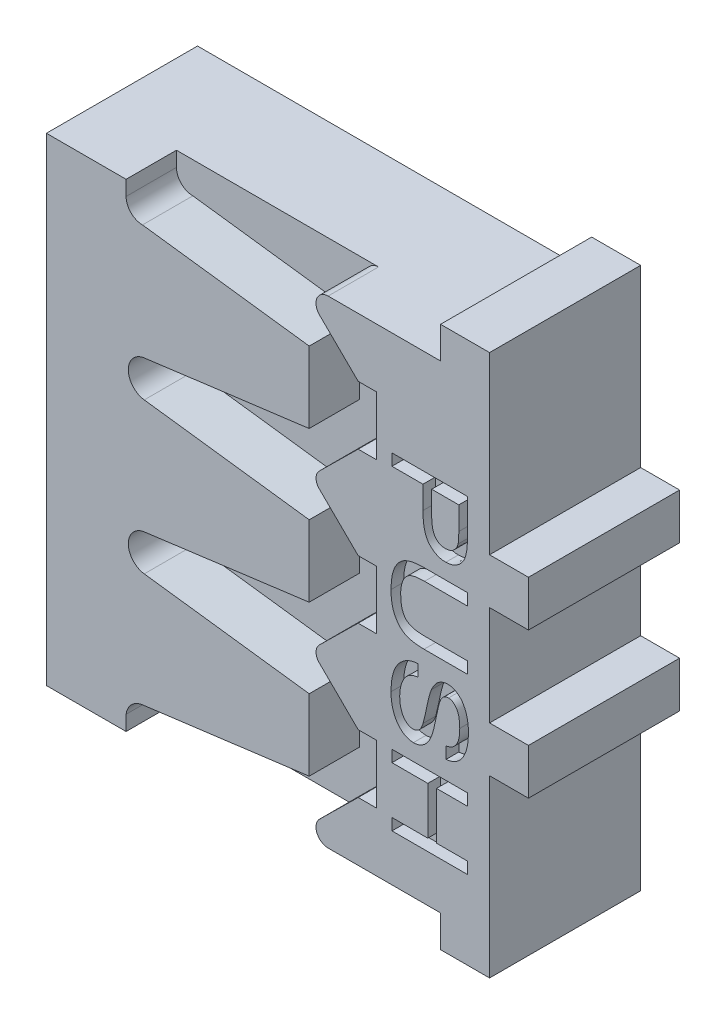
from build123d import *

# Parameters (mm, degrees)
EXTRUSION1_DEPTH                  = 1.2
ENL_V_START                       = -1.2
ENL_V_MAT_EXTRU_1_DEPTH           = 0.4
ESQUISSE4_W                       = 0.8
ESQUISSE4_H                       = 1
ENL_V_MAT_EXTRU_2_DEPTH           = 2
ENL_V_MAT_EXTRU_2_DRAFT           = -10
ENL_V_MAT_EXTRU_2_PROFILE_2_DEPTH = 2
ENL_V_MAT_EXTRU_2_PROFILE_2_DRAFT = -10
ENL_V_MAT_EXTRU_2_PROFILE_3_DEPTH = 2
ENL_V_MAT_EXTRU_2_PROFILE_3_DRAFT = -10
ENL_V_MAT_EXTRU_3_DEPTH           = 0.1


with BuildPart() as part:
    # Esquisse2 → Extrusion1 (new body)
    with BuildSketch(Plane.XY):
        Polygon((-3.519339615, -1.899454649), (-0.389123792, -1.89807661), (-0.389123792, -2.150946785), (0, -2.150946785), (0, -0.759816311), (0.309025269, -0.759816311), (0.309025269, -0.396703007), (0, -0.396703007), (0, 0.396703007), (0.309025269, 0.396703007), (0.309025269, 0.759816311), (0, 0.759816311), (0, 2.150602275), (-0.389123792, 2.150602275), (-0.389123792, 1.89807661), (-3.519339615, 1.899454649), align=None)
    extrude(amount=-EXTRUSION1_DEPTH)

    # Esquisse3 → Enl_v. mat.-Extru.1 (cut)
    with BuildSketch(Plane(origin=(0, 0, -1.2), x_dir=(-1, 0, 0), z_dir=(0, 0, -1)).offset(ENL_V_START)):
        with BuildLine():
            Line((2.886647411, 1.899454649), (2.886647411, 1.780943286))
            ThreePointArc((2.886647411, 1.780943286), (2.848526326, 1.688738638), (2.756422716, 1.650374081))
            Line((2.756422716, 1.650374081), (1.432471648, 1.479152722))
            Line((1.432471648, 1.479152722), (1.432471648, 0.912089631))
            Line((1.432471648, 0.912089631), (2.742297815, 0.742590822))
            ThreePointArc((2.742297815, 0.742590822), (2.869171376, 0.598241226), (2.742297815, 0.45389163))
            Line((2.742297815, 0.45389163), (1.432471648, 0.28439282))
            Line((1.432471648, 0.28439282), (1.432471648, -0.282670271))
            Line((1.432471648, -0.282670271), (2.742297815, -0.45389163))
            ThreePointArc((2.742297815, -0.45389163), (2.869006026, -0.598241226), (2.742297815, -0.742590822))
            Line((2.742297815, -0.742590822), (1.432471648, -0.912089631))
            Line((1.432471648, -0.912089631), (1.432471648, -1.479152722))
            Line((1.432471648, -1.479152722), (2.756422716, -1.650374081))
            ThreePointArc((2.756422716, -1.650374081), (2.843720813, -1.693300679), (2.886647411, -1.780598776))
            Line((2.886647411, -1.780598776), (2.886647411, -1.899454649))
            Line((2.886647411, -1.899454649), (2.886647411, -1.94882687))
            Line((2.886647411, -1.94882687), (1.281920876, -1.94882687))
            Line((1.281920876, -1.94882687), (1.281920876, -1.89807661))
            ThreePointArc((1.281920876, -1.89807661), (1.370634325, -1.839666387), (1.35185636, -1.735123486))
            Line((1.35185636, -1.735123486), (1.043520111, -1.431265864))
            Line((1.043520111, -1.431265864), (0.899859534, -1.431265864))
            Line((0.899859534, -1.431265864), (0.899859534, -0.964455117))
            Line((0.899859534, -0.964455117), (1.043520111, -0.964455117))
            Line((1.043520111, -0.964455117), (1.35185636, -0.660597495))
            ThreePointArc((1.35185636, -0.660597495), (1.377880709, -0.598413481), (1.35185636, -0.536229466))
            Line((1.35185636, -0.536229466), (1.043520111, -0.232371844))
            Line((1.043520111, -0.232371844), (0.899859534, -0.232371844))
            Line((0.899859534, -0.232371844), (0.899859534, 0.232371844))
            Line((0.899859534, 0.232371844), (1.043520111, 0.232371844))
            Line((1.043520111, 0.232371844), (1.35185636, 0.536229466))
            ThreePointArc((1.35185636, 0.536229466), (1.377808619, 0.598241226), (1.35185636, 0.660252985))
            Line((1.35185636, 0.660252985), (1.043520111, 0.964455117))
            Line((1.043520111, 0.964455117), (0.899859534, 0.964455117))
            Line((0.899859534, 0.964455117), (0.899859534, 1.431265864))
            Line((0.899859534, 1.431265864), (1.043520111, 1.431265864))
            Line((1.043520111, 1.431265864), (1.35185636, 1.735123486))
            ThreePointArc((1.35185636, 1.735123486), (1.370634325, 1.839666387), (1.281920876, 1.89807661))
            Line((1.281920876, 1.89807661), (1.281920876, 1.925522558))
            Line((1.281920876, 1.925522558), (2.886647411, 1.925522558))
            Line((2.886647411, 1.925522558), (2.886647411, 1.899454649))
        make_face()
    extrude(amount=ENL_V_MAT_EXTRU_1_DEPTH, mode=Mode.SUBTRACT)


with BuildPart() as enl_v_mat_extru_2_tool:
    # Esquisse4 → Enl_v. mat.-Extru.2 (with draft: the straight prism first)
    with BuildSketch(Plane.ZY.offset(3.519339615)):
        with Locations((-0.6, 1.2)):
            Rectangle(ESQUISSE4_W, ESQUISSE4_H)
    extrude(amount=-ENL_V_MAT_EXTRU_2_DEPTH)
    # Enl_v. mat.-Extru.2: the draft: its side faces are tilted about the plane it starts from
    enl_v_mat_extru_2_sides = [enl_v_mat_extru_2_tool.faces().sort_by_distance(p)[0] for p in [
        (-2.519339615, 1.7, -0.6),
        (-2.519339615, 1.2, -1),
        (-2.519339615, 0.7, -0.6),
        (-2.519339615, 1.2, -0.2),
    ]]
    draft(enl_v_mat_extru_2_sides, Plane.ZY.offset(3.519339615), ENL_V_MAT_EXTRU_2_DRAFT)


with BuildPart() as part_1:
    add(part.part)

    # Enl_v. mat.-Extru.2: cut by enl_v_mat_extru_2_tool
    add(enl_v_mat_extru_2_tool.part, mode=Mode.SUBTRACT)


with BuildPart() as enl_v_mat_extru_2_profile_2_tool:
    # Esquisse4 → Enl_v. mat.-Extru.2 profile 2 (with draft: the straight prism first)
    with BuildSketch(Plane.ZY.offset(3.519339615)):
        with Locations((-0.6, 0)):
            Rectangle(ESQUISSE4_W, ESQUISSE4_H)
    extrude(amount=-ENL_V_MAT_EXTRU_2_PROFILE_2_DEPTH)
    # Enl_v. mat.-Extru.2 profile 2: the draft: its side faces are tilted about the plane it starts from
    enl_v_mat_extru_2_profile_2_sides = [enl_v_mat_extru_2_profile_2_tool.faces().sort_by_distance(p)[0] for p in [
        (-2.519339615, 0.5, -0.6),
        (-2.519339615, 0, -1),
        (-2.519339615, -0.5, -0.6),
        (-2.519339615, 0, -0.2),
    ]]
    draft(enl_v_mat_extru_2_profile_2_sides, Plane.ZY.offset(3.519339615), ENL_V_MAT_EXTRU_2_PROFILE_2_DRAFT)


with BuildPart() as part_2:
    add(part_1.part)

    # Enl_v. mat.-Extru.2 profile 2: cut by enl_v_mat_extru_2_profile_2_tool
    add(enl_v_mat_extru_2_profile_2_tool.part, mode=Mode.SUBTRACT)


with BuildPart() as enl_v_mat_extru_2_profile_3_tool:
    # Esquisse4 → Enl_v. mat.-Extru.2 profile 3 (with draft: the straight prism first)
    with BuildSketch(Plane.ZY.offset(3.519339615)):
        with Locations((-0.6, -1.2)):
            Rectangle(ESQUISSE4_W, ESQUISSE4_H)
    extrude(amount=-ENL_V_MAT_EXTRU_2_PROFILE_3_DEPTH)
    # Enl_v. mat.-Extru.2 profile 3: the draft: its side faces are tilted about the plane it starts from
    enl_v_mat_extru_2_profile_3_sides = [enl_v_mat_extru_2_profile_3_tool.faces().sort_by_distance(p)[0] for p in [
        (-2.519339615, -0.7, -0.6),
        (-2.519339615, -1.2, -1),
        (-2.519339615, -1.7, -0.6),
        (-2.519339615, -1.2, -0.2),
    ]]
    draft(enl_v_mat_extru_2_profile_3_sides, Plane.ZY.offset(3.519339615), ENL_V_MAT_EXTRU_2_PROFILE_3_DRAFT)


with BuildPart() as part_3:
    add(part_2.part)

    # Enl_v. mat.-Extru.2 profile 3: cut by enl_v_mat_extru_2_profile_3_tool
    add(enl_v_mat_extru_2_profile_3_tool.part, mode=Mode.SUBTRACT)

    # Esquisse6 → Enl_v. mat.-Extru.3 (cut)
    # profile 1 of 4: a face of its own
    with BuildSketch(Plane.XY):
        with BuildLine():
            Line((-0.775194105, 1.07322281), (-0.175194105, 1.07322281))
            Line((-0.175194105, 1.07322281), (-0.175194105, 0.80711704))
            add(Edge.make_bspline(
                [(-0.175194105, 0.80711704), (-0.175228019, 0.801427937), (-0.1752937, 0.790409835), (-0.175489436, 0.774421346), (-0.176002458, 0.759477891), (-0.176601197, 0.745535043), (-0.177271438, 0.732626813), (-0.178232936, 0.720762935), (-0.179435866, 0.709945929), (-0.180388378, 0.703068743), (-0.180843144, 0.69978531)],
                knots=[0, 0, 0, 0, 1.269345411, 2.458344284, 3.56733582, 4.605202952, 5.572085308, 6.451004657, 7.260450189, 8, 8, 8, 8], degree=3))
            add(Edge.make_bspline(
                [(-0.180843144, 0.69978531), (-0.182176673, 0.691462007), (-0.184757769, 0.675351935), (-0.190943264, 0.652417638), (-0.198678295, 0.631510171), (-0.20824188, 0.61265045), (-0.219616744, 0.595691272), (-0.233171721, 0.580617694), (-0.248729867, 0.567256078), (-0.266164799, 0.555743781), (-0.285013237, 0.546337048), (-0.305106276, 0.53976258), (-0.326051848, 0.535447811), (-0.340396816, 0.534992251), (-0.347670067, 0.534761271)],
                knots=[0, 0, 0, 0, 1.172642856, 2.269695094, 3.30028765, 4.270448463, 5.206197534, 6.134271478, 7.083302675, 8.053062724, 9.035676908, 10.005581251, 10.988780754, 12, 12, 12, 12], degree=3))
            add(Edge.make_bspline(
                [(-0.347670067, 0.534761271), (-0.353891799, 0.534894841), (-0.366159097, 0.535158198), (-0.384145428, 0.538088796), (-0.401450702, 0.542474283), (-0.418018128, 0.548778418), (-0.433845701, 0.556892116), (-0.448947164, 0.56677014), (-0.463164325, 0.578622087), (-0.476945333, 0.592039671), (-0.489454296, 0.608052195), (-0.500188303, 0.626969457), (-0.509129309, 0.64876271), (-0.516350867, 0.673400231), (-0.522072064, 0.700853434), (-0.526243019, 0.731166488), (-0.52856207, 0.76441231), (-0.528876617, 0.787522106), (-0.529040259, 0.799544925)],
                knots=[0, 0, 0, 0, 0.820402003, 1.61757449, 2.398590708, 3.17340736, 3.951410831, 4.741873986, 5.54955128, 6.390799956, 7.276093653, 8.221156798, 9.252224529, 10.378070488, 11.604879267, 12.950126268, 14.413310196, 16, 16, 16, 16], degree=3))
            Line((-0.529040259, 0.799544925), (-0.529040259, 0.980915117))
            Line((-0.529040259, 0.980915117), (-0.775194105, 0.980915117))
            Line((-0.775194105, 0.980915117), (-0.775194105, 1.07322281))
        make_face()
        with BuildLine():
            Line((-0.45980949, 0.980915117), (-0.45980949, 0.795939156))
            add(Edge.make_bspline(
                [(-0.45980949, 0.795939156), (-0.45971218, 0.788565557), (-0.459524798, 0.77436676), (-0.458243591, 0.75390069), (-0.455975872, 0.735121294), (-0.452871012, 0.71797572), (-0.448989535, 0.70242658), (-0.444094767, 0.688512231), (-0.438214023, 0.676289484), (-0.431429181, 0.665671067), (-0.423760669, 0.656570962), (-0.415383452, 0.648707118), (-0.406364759, 0.641847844), (-0.396424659, 0.636493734), (-0.385871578, 0.632217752), (-0.374568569, 0.629223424), (-0.36255342, 0.627399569), (-0.354287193, 0.627180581), (-0.350073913, 0.627068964)],
                knots=[0, 0, 0, 0, 1.547334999, 2.979589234, 4.300842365, 5.514546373, 6.634031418, 7.660497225, 8.604305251, 9.474181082, 10.297681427, 11.0946609, 11.881599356, 12.667998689, 13.45641783, 14.266068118, 15.116218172, 16, 16, 16, 16], degree=3))
            add(Edge.make_bspline(
                [(-0.350073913, 0.627068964), (-0.343958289, 0.627337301), (-0.332054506, 0.627859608), (-0.314895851, 0.632200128), (-0.299111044, 0.639378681), (-0.28497787, 0.649454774), (-0.272534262, 0.661652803), (-0.262536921, 0.675992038), (-0.254419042, 0.691915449), (-0.251307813, 0.703555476), (-0.249713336, 0.709520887)],
                knots=[0, 0, 0, 0, 1.041408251, 2.0270537, 2.995919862, 3.981281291, 4.971365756, 5.951148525, 6.949981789, 8, 8, 8, 8], degree=3))
            add(Edge.make_bspline(
                [(-0.249713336, 0.709520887), (-0.249291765, 0.711721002), (-0.248367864, 0.716542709), (-0.247357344, 0.72445186), (-0.246359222, 0.733582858), (-0.245707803, 0.743971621), (-0.245061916, 0.755628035), (-0.244766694, 0.768574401), (-0.244508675, 0.782797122), (-0.244453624, 0.792693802), (-0.244424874, 0.797862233)],
                knots=[0, 0, 0, 0, 0.606528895, 1.329250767, 2.158400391, 3.093761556, 4.147600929, 5.319844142, 6.600318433, 8, 8, 8, 8], degree=3))
            Line((-0.244424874, 0.797862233), (-0.244424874, 0.980915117))
            Line((-0.244424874, 0.980915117), (-0.45980949, 0.980915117))
        make_face(mode=Mode.SUBTRACT)
    # profile 2 of 4: a face of its own
    with BuildSketch(Plane.XY):
        with BuildLine():
            Line((-0.175194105, -0.057546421), (-0.175194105, -0.149854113))
            Line((-0.175194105, -0.149854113), (-0.520386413, -0.149854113))
            add(Edge.make_bspline(
                [(-0.520386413, -0.149854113), (-0.527720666, -0.149805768), (-0.541999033, -0.14971165), (-0.562794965, -0.148382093), (-0.58247625, -0.146757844), (-0.600935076, -0.143872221), (-0.618307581, -0.140635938), (-0.634467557, -0.13637951), (-0.649492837, -0.1314843), (-0.663517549, -0.125867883), (-0.67655064, -0.118984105), (-0.688942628, -0.111087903), (-0.700699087, -0.101872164), (-0.711701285, -0.09135999), (-0.722264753, -0.079771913), (-0.732083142, -0.066858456), (-0.741340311, -0.052752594), (-0.750007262, -0.037493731), (-0.757874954, -0.020989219), (-0.764563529, -0.003161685), (-0.770188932, 0.015932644), (-0.774866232, 0.036198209), (-0.778432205, 0.057720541), (-0.78106987, 0.080420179), (-0.782653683, 0.104409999), (-0.782807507, 0.120816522), (-0.782886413, 0.129232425)],
                knots=[0, 0, 0, 0, 1.190898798, 2.31844891, 3.383533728, 4.396690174, 5.351213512, 6.252371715, 7.10835201, 7.916711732, 8.702523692, 9.498506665, 10.300319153, 11.124215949, 11.967213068, 12.844372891, 13.755738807, 14.705660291, 15.692332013, 16.721965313, 17.79455647, 18.923101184, 20.097640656, 21.335723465, 22.633330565, 24, 24, 24, 24], degree=3))
            add(Edge.make_bspline(
                [(-0.782886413, 0.129232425), (-0.782786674, 0.137407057), (-0.782591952, 0.153366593), (-0.781291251, 0.176750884), (-0.778985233, 0.199001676), (-0.77592876, 0.220157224), (-0.7718652, 0.240151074), (-0.766786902, 0.258958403), (-0.760932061, 0.276633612), (-0.754219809, 0.293216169), (-0.746472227, 0.308582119), (-0.7381143, 0.322953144), (-0.728839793, 0.336118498), (-0.718678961, 0.348041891), (-0.707829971, 0.358944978), (-0.696150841, 0.368720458), (-0.683594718, 0.377302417), (-0.670106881, 0.384650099), (-0.6556401, 0.391088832), (-0.639989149, 0.396567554), (-0.623085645, 0.401261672), (-0.604971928, 0.40505012), (-0.585596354, 0.408061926), (-0.564979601, 0.410215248), (-0.543075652, 0.411358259), (-0.528079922, 0.411573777), (-0.520386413, 0.411684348)],
                knots=[0, 0, 0, 0, 1.314992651, 2.567292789, 3.765853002, 4.912448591, 6.004495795, 7.045685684, 8.044318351, 8.998171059, 9.920476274, 10.810256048, 11.670341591, 12.507099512, 13.327389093, 14.141834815, 14.953394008, 15.76967361, 16.609231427, 17.497960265, 18.434587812, 19.429365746, 20.473045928, 21.587605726, 22.762329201, 24, 24, 24, 24], degree=3))
            Line((-0.520386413, 0.411684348), (-0.175194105, 0.411684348))
            Line((-0.175194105, 0.411684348), (-0.175194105, 0.319376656))
            Line((-0.175194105, 0.319376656), (-0.516420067, 0.319376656))
            add(Edge.make_bspline(
                [(-0.516420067, 0.319376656), (-0.522630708, 0.319340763), (-0.534617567, 0.319271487), (-0.551983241, 0.318454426), (-0.568081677, 0.316929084), (-0.58300043, 0.31529924), (-0.596581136, 0.312705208), (-0.608934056, 0.309769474), (-0.61997956, 0.306172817), (-0.629944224, 0.302057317), (-0.638937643, 0.297178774), (-0.647274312, 0.291590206), (-0.655160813, 0.285364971), (-0.662380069, 0.278138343), (-0.669275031, 0.270260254), (-0.675469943, 0.261409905), (-0.68127842, 0.251928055), (-0.688248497, 0.238014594), (-0.69558671, 0.218924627), (-0.701560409, 0.193867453), (-0.705389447, 0.166489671), (-0.705766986, 0.147435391), (-0.705963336, 0.137525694)],
                knots=[0, 0, 0, 0, 1.215287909, 2.34556869, 3.400321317, 4.379557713, 5.280636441, 6.103976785, 6.862627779, 7.551336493, 8.210821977, 8.860967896, 9.513567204, 10.173285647, 10.856978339, 11.559646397, 12.284361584, 13.0311726, 14.602151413, 16.273543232, 18.061954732, 20, 20, 20, 20], degree=3))
            add(Edge.make_bspline(
                [(-0.705963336, 0.137525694), (-0.705851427, 0.129069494), (-0.705635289, 0.112737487), (-0.703891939, 0.089162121), (-0.700731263, 0.06749965), (-0.696666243, 0.047675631), (-0.691102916, 0.029782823), (-0.684441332, 0.013703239), (-0.676485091, -0.000482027), (-0.66724901, -0.012991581), (-0.655979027, -0.023693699), (-0.642614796, -0.032841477), (-0.627003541, -0.040521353), (-0.609222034, -0.04687034), (-0.58915479, -0.051725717), (-0.566878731, -0.055130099), (-0.542378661, -0.057145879), (-0.525318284, -0.057409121), (-0.516420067, -0.057546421)],
                knots=[0, 0, 0, 0, 1.269421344, 2.451715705, 3.545566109, 4.55416113, 5.486315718, 6.354264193, 7.162205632, 7.922442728, 8.679652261, 9.483801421, 10.344530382, 11.284375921, 12.312789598, 13.439064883, 14.664287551, 16, 16, 16, 16], degree=3))
            Line((-0.516420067, -0.057546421), (-0.175194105, -0.057546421))
        make_face()
    # profile 3 of 4: a face of its own
    with BuildSketch(Plane.XY):
        with BuildLine():
            Line((-0.567501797, -0.272931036), (-0.567501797, -0.365238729))
            add(Edge.make_bspline(
                [(-0.567501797, -0.365238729), (-0.57511119, -0.3664225), (-0.589791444, -0.368706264), (-0.61053705, -0.374925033), (-0.629208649, -0.383062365), (-0.645950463, -0.39338884), (-0.660774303, -0.406553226), (-0.673872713, -0.422705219), (-0.68538587, -0.442002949), (-0.695513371, -0.463927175), (-0.703552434, -0.48821376), (-0.709451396, -0.514166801), (-0.712975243, -0.541624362), (-0.71342521, -0.560420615), (-0.713655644, -0.570046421)],
                knots=[0, 0, 0, 0, 0.992214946, 1.914209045, 2.784026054, 3.61267751, 4.439958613, 5.328450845, 6.283694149, 7.330939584, 8.437097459, 9.57646081, 10.758873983, 12, 12, 12, 12], degree=3))
            add(Edge.make_bspline(
                [(-0.713655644, -0.570046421), (-0.713532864, -0.578549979), (-0.71329413, -0.59508441), (-0.710331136, -0.619087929), (-0.706228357, -0.641636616), (-0.699945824, -0.662388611), (-0.692252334, -0.68111977), (-0.683127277, -0.697526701), (-0.672635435, -0.711448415), (-0.660844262, -0.722672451), (-0.648253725, -0.731249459), (-0.635393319, -0.737489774), (-0.622264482, -0.741476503), (-0.613361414, -0.741935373), (-0.608968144, -0.742161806)],
                knots=[0, 0, 0, 0, 1.374899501, 2.673372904, 3.907734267, 5.078653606, 6.174085, 7.178268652, 8.10779742, 8.9835181, 9.799741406, 10.562205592, 11.290512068, 12, 12, 12, 12], degree=3))
            add(Edge.make_bspline(
                [(-0.608968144, -0.742161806), (-0.604621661, -0.741954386), (-0.59609239, -0.741547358), (-0.583788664, -0.738322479), (-0.572346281, -0.733044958), (-0.563646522, -0.726888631), (-0.557042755, -0.720875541), (-0.552412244, -0.71525077), (-0.547798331, -0.708848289), (-0.543430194, -0.70154758), (-0.539153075, -0.693428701), (-0.535275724, -0.684381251), (-0.531353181, -0.674518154), (-0.529117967, -0.667537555), (-0.527958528, -0.663916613)],
                knots=[0, 0, 0, 0, 1.281814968, 2.51535541, 3.727214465, 4.983955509, 5.645141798, 6.358438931, 7.129780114, 7.973615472, 8.867680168, 9.836826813, 10.87792966, 12, 12, 12, 12], degree=3))
            add(Edge.make_bspline(
                [(-0.527958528, -0.663916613), (-0.527092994, -0.661159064), (-0.525147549, -0.654960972), (-0.522512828, -0.644443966), (-0.519162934, -0.631830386), (-0.515766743, -0.616981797), (-0.512027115, -0.599948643), (-0.507981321, -0.580788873), (-0.503493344, -0.559443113), (-0.498884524, -0.536582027), (-0.49410305, -0.513530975), (-0.489349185, -0.491632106), (-0.484501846, -0.471576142), (-0.479899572, -0.453310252), (-0.475184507, -0.436935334), (-0.470616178, -0.422389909), (-0.466302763, -0.409611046), (-0.463017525, -0.401880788), (-0.461492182, -0.398291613)],
                knots=[0, 0, 0, 0, 0.505965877, 1.137250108, 1.897802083, 2.791151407, 3.803909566, 4.951393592, 6.219911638, 7.623219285, 9.034813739, 10.342040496, 11.5467049, 12.647544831, 13.640056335, 14.529762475, 15.317365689, 16, 16, 16, 16], degree=3))
            add(Edge.make_bspline(
                [(-0.461492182, -0.398291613), (-0.459618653, -0.39410076), (-0.455952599, -0.385900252), (-0.449727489, -0.374255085), (-0.44347352, -0.363284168), (-0.436642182, -0.35326602), (-0.429640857, -0.343987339), (-0.422093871, -0.33565551), (-0.414320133, -0.328087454), (-0.403659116, -0.319144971), (-0.389429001, -0.30990122), (-0.371112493, -0.301932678), (-0.351790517, -0.29682771), (-0.338527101, -0.29628369), (-0.331804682, -0.29600796)],
                knots=[0, 0, 0, 0, 0.940377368, 1.840096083, 2.704667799, 3.526678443, 4.323076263, 5.084647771, 5.827809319, 6.544703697, 7.933794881, 9.286727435, 10.624807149, 12, 12, 12, 12], degree=3))
            add(Edge.make_bspline(
                [(-0.331804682, -0.29600796), (-0.328074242, -0.29610068), (-0.320625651, -0.296285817), (-0.309562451, -0.297771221), (-0.298669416, -0.300194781), (-0.287996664, -0.303533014), (-0.277506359, -0.307940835), (-0.2672564, -0.313357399), (-0.257104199, -0.319616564), (-0.247240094, -0.326830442), (-0.237790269, -0.335019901), (-0.228695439, -0.343983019), (-0.220465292, -0.354092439), (-0.212547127, -0.36486356), (-0.205554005, -0.376754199), (-0.198868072, -0.38932416), (-0.193025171, -0.402916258), (-0.185782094, -0.422199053), (-0.178373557, -0.44783754), (-0.172026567, -0.480084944), (-0.168285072, -0.514028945), (-0.167766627, -0.537184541), (-0.167501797, -0.549012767)],
                knots=[0, 0, 0, 0, 0.667440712, 1.332682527, 1.993737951, 2.662717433, 3.331197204, 4.027145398, 4.73550424, 5.464042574, 6.211425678, 6.971935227, 7.745846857, 8.541862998, 9.362054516, 10.211952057, 11.088501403, 12.007428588, 13.897481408, 15.856298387, 17.883334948, 20, 20, 20, 20], degree=3))
            add(Edge.make_bspline(
                [(-0.167501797, -0.549012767), (-0.167746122, -0.561922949), (-0.16822158, -0.587046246), (-0.1721734, -0.623571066), (-0.178951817, -0.657721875), (-0.186562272, -0.684569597), (-0.194250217, -0.704518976), (-0.20033398, -0.718541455), (-0.207142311, -0.731675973), (-0.214847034, -0.743794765), (-0.222741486, -0.755310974), (-0.231689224, -0.765648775), (-0.240984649, -0.775309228), (-0.250986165, -0.783964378), (-0.261489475, -0.791633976), (-0.272235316, -0.798527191), (-0.28344862, -0.80432037), (-0.294905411, -0.809280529), (-0.306840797, -0.813116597), (-0.319044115, -0.816118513), (-0.331621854, -0.818220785), (-0.340130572, -0.818795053), (-0.344424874, -0.819084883)],
                knots=[0, 0, 0, 0, 2.158621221, 4.200690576, 6.133523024, 7.975991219, 8.858190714, 9.707174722, 10.531287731, 11.328827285, 12.107687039, 12.863468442, 13.612058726, 14.348223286, 15.071841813, 15.785591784, 16.480831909, 17.180224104, 17.870929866, 18.574545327, 19.280580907, 20, 20, 20, 20], degree=3))
            Line((-0.344424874, -0.819084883), (-0.344424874, -0.72677719))
            add(Edge.make_bspline(
                [(-0.344424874, -0.72677719), (-0.340120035, -0.726060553), (-0.331659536, -0.724652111), (-0.319496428, -0.721130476), (-0.308122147, -0.716569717), (-0.297593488, -0.710890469), (-0.28790402, -0.70412389), (-0.279076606, -0.696214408), (-0.270986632, -0.687296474), (-0.263720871, -0.677226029), (-0.257351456, -0.665969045), (-0.251804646, -0.653491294), (-0.247143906, -0.639724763), (-0.243337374, -0.62468819), (-0.240366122, -0.608423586), (-0.238183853, -0.590930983), (-0.237058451, -0.572184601), (-0.236843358, -0.55927046), (-0.236732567, -0.552618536)],
                knots=[0, 0, 0, 0, 0.922979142, 1.813973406, 2.673674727, 3.512122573, 4.340129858, 5.168918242, 6.015345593, 6.883742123, 7.791365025, 8.74785392, 9.769474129, 10.863544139, 12.027688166, 13.2665983, 14.59205668, 16, 16, 16, 16], degree=3))
            add(Edge.make_bspline(
                [(-0.236732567, -0.552618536), (-0.23677391, -0.545724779), (-0.236854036, -0.532364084), (-0.238255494, -0.513077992), (-0.240219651, -0.495214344), (-0.243063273, -0.478820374), (-0.246814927, -0.463897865), (-0.251121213, -0.450338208), (-0.256625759, -0.438357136), (-0.2627346, -0.427722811), (-0.269472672, -0.418454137), (-0.276601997, -0.410483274), (-0.283958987, -0.403652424), (-0.291718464, -0.398019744), (-0.29991476, -0.393711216), (-0.308375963, -0.390514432), (-0.317219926, -0.388647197), (-0.323222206, -0.388427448), (-0.326275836, -0.388315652)],
                knots=[0, 0, 0, 0, 1.59709723, 3.095311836, 4.47838408, 5.760522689, 6.947173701, 8.042257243, 9.051872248, 9.996155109, 10.88009099, 11.701977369, 12.470760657, 13.202493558, 13.916821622, 14.610084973, 15.292887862, 16, 16, 16, 16], degree=3))
            add(Edge.make_bspline(
                [(-0.326275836, -0.388315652), (-0.328922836, -0.388427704), (-0.334083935, -0.388646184), (-0.34171754, -0.389789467), (-0.348852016, -0.39215468), (-0.355761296, -0.395155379), (-0.362176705, -0.399194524), (-0.368466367, -0.403843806), (-0.374035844, -0.409739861), (-0.377506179, -0.414014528), (-0.379280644, -0.416200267)],
                knots=[0, 0, 0, 0, 1.020889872, 1.990522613, 2.962242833, 3.909113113, 4.886215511, 5.87748745, 6.91470889, 8, 8, 8, 8], degree=3))
            add(Edge.make_bspline(
                [(-0.379280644, -0.416200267), (-0.381067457, -0.418887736), (-0.385099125, -0.424951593), (-0.390207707, -0.436039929), (-0.395459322, -0.44977998), (-0.400690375, -0.466291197), (-0.405909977, -0.485562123), (-0.411302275, -0.507518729), (-0.416729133, -0.532242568), (-0.421819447, -0.558910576), (-0.427048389, -0.585773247), (-0.432223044, -0.611133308), (-0.437101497, -0.634231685), (-0.44190859, -0.65502825), (-0.446525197, -0.673522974), (-0.451160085, -0.689682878), (-0.455355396, -0.703595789), (-0.458414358, -0.712004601), (-0.45980949, -0.71583969)],
                knots=[0, 0, 0, 0, 0.496959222, 1.121311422, 1.876102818, 2.764905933, 3.789892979, 4.953932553, 6.250338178, 7.691891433, 9.139506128, 10.46961288, 11.682308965, 12.77909787, 13.760364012, 14.620701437, 15.370929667, 16, 16, 16, 16], degree=3))
            add(Edge.make_bspline(
                [(-0.45980949, -0.71583969), (-0.461795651, -0.720752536), (-0.465683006, -0.730368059), (-0.472347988, -0.744050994), (-0.479268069, -0.756802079), (-0.486619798, -0.768549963), (-0.494442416, -0.779249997), (-0.502627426, -0.789012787), (-0.511137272, -0.797869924), (-0.520205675, -0.805570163), (-0.52961769, -0.812289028), (-0.539295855, -0.818276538), (-0.549357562, -0.823286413), (-0.559791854, -0.827461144), (-0.570607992, -0.830506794), (-0.581721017, -0.832854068), (-0.593191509, -0.834166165), (-0.60095223, -0.834367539), (-0.604881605, -0.834469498)],
                knots=[0, 0, 0, 0, 1.268262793, 2.48226994, 3.641188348, 4.740216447, 5.797260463, 6.811625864, 7.788336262, 8.733989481, 9.654951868, 10.554744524, 11.455507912, 12.342480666, 13.240994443, 14.142013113, 15.059272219, 16, 16, 16, 16], degree=3))
            add(Edge.make_bspline(
                [(-0.604881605, -0.834469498), (-0.608813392, -0.834387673), (-0.616668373, -0.8342242), (-0.628324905, -0.832574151), (-0.63978443, -0.83006525), (-0.65108927, -0.826537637), (-0.662214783, -0.821969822), (-0.673183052, -0.816418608), (-0.683955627, -0.809874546), (-0.694482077, -0.802322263), (-0.704669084, -0.793829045), (-0.714296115, -0.784412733), (-0.723388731, -0.774166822), (-0.731696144, -0.762923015), (-0.739807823, -0.751031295), (-0.74684453, -0.737987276), (-0.753693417, -0.72426019), (-0.761835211, -0.704555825), (-0.770489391, -0.678356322), (-0.777489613, -0.645091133), (-0.782165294, -0.610002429), (-0.782642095, -0.585967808), (-0.782886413, -0.57365219)],
                knots=[0, 0, 0, 0, 0.673162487, 1.344853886, 2.012606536, 2.681205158, 3.370718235, 4.070538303, 4.785013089, 5.527803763, 6.287926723, 7.054774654, 7.832782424, 8.631670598, 9.448286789, 10.296229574, 11.167948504, 12.075487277, 13.946360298, 15.884872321, 17.891360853, 20, 20, 20, 20], degree=3))
            add(Edge.make_bspline(
                [(-0.782886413, -0.57365219), (-0.782832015, -0.565837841), (-0.782725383, -0.550519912), (-0.781453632, -0.528032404), (-0.779596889, -0.506492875), (-0.7768461, -0.485913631), (-0.773223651, -0.466310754), (-0.768934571, -0.447689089), (-0.763875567, -0.430024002), (-0.758027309, -0.413304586), (-0.751234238, -0.397527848), (-0.743842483, -0.382574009), (-0.735499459, -0.368567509), (-0.726340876, -0.355465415), (-0.71647351, -0.343130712), (-0.705779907, -0.331723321), (-0.694289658, -0.321194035), (-0.682055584, -0.311617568), (-0.669235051, -0.302992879), (-0.655958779, -0.295360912), (-0.642214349, -0.288848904), (-0.628053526, -0.283473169), (-0.613522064, -0.279097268), (-0.598582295, -0.275823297), (-0.583174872, -0.273813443), (-0.572755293, -0.273226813), (-0.567501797, -0.272931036)],
                knots=[0, 0, 0, 0, 1.357488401, 2.660990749, 3.911915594, 5.112906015, 6.266549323, 7.374168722, 8.431638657, 9.457526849, 10.449194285, 11.414193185, 12.353675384, 13.278604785, 14.189573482, 15.095689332, 15.992344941, 16.89465638, 17.792365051, 18.674722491, 19.552758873, 20.431815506, 21.303872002, 22.187217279, 23.086004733, 24, 24, 24, 24], degree=3))
        make_face()
    # profile 4 of 4: a face of its own
    with BuildSketch(Plane.XY):
        Polygon((-0.775194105, -0.965238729), (-0.175194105, -0.965238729), (-0.175194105, -1.057546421), (-0.421347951, -1.057546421), (-0.421347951, -1.434469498), (-0.175194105, -1.434469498), (-0.175194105, -1.52677719), (-0.775194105, -1.52677719), (-0.775194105, -1.434469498), (-0.49057872, -1.434469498), (-0.49057872, -1.057546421), (-0.775194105, -1.057546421), align=None)
    extrude(amount=-ENL_V_MAT_EXTRU_3_DEPTH, mode=Mode.SUBTRACT)


solid = part_3.part
